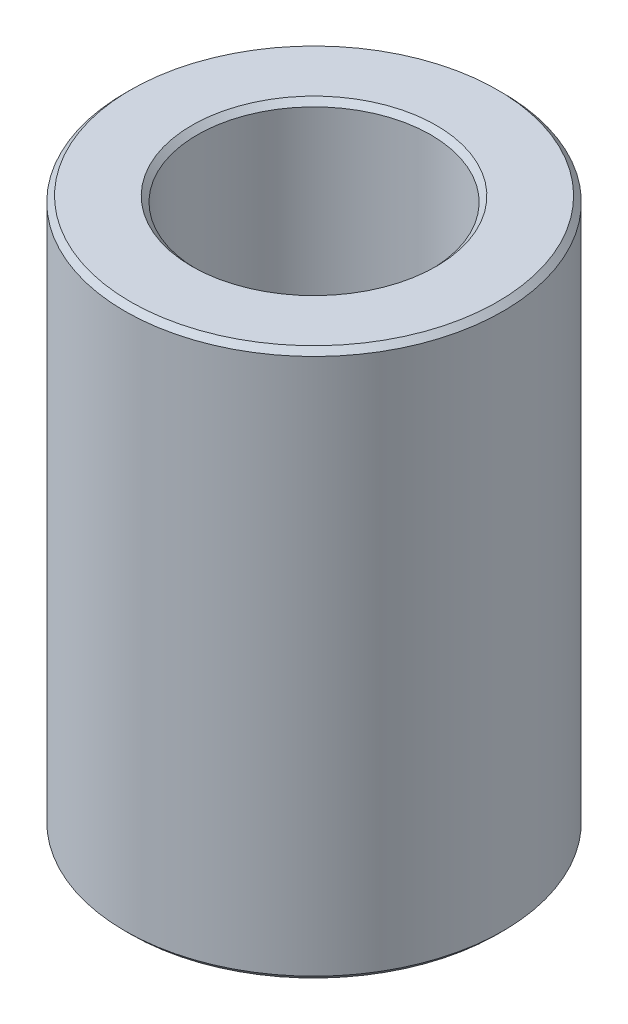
ISO-10303-21;
HEADER;
FILE_DESCRIPTION(('STEP AP214'),'2;1');
FILE_NAME('part.step','',(''),(''),'','','');
FILE_SCHEMA(('AUTOMOTIVE_DESIGN { 1 0 10303 214 1 1 1 1 }'));
ENDSEC;
DATA;
#1=APPLICATION_CONTEXT('core data for automotive mechanical design processes');
#2=APPLICATION_PROTOCOL_DEFINITION('international standard','automotive_design',2000,#1);
#3=PRODUCT_CONTEXT('',#1,'mechanical');
#4=PRODUCT('Part','Part','',(#3));
#5=PRODUCT_RELATED_PRODUCT_CATEGORY('part','',(#4));
#6=PRODUCT_DEFINITION_FORMATION('','',#4);
#7=PRODUCT_DEFINITION_CONTEXT('part definition',#1,'design');
#8=PRODUCT_DEFINITION('design','',#6,#7);
#9=PRODUCT_DEFINITION_SHAPE('','',#8);
#10=(LENGTH_UNIT() NAMED_UNIT(*) SI_UNIT(.MILLI.,.METRE.));
#11=(NAMED_UNIT(*) PLANE_ANGLE_UNIT() SI_UNIT($,.RADIAN.));
#12=(NAMED_UNIT(*) SI_UNIT($,.STERADIAN.) SOLID_ANGLE_UNIT());
#13=UNCERTAINTY_MEASURE_WITH_UNIT(LENGTH_MEASURE(1.E-05),#10,'distance_accuracy_value','');
#14=(GEOMETRIC_REPRESENTATION_CONTEXT(3) GLOBAL_UNCERTAINTY_ASSIGNED_CONTEXT((#13)) GLOBAL_UNIT_ASSIGNED_CONTEXT((#10,
#11,#12)) REPRESENTATION_CONTEXT('',''));
#15=CARTESIAN_POINT('',(0.,0.,0.));
#16=DIRECTION('',(0.,0.,1.));
#17=DIRECTION('',(1.,0.,0.));
#18=AXIS2_PLACEMENT_3D('',#15,#16,#17);
#19=CARTESIAN_POINT('',(0.,12.51,0.));
#20=DIRECTION('',(0.,1.,0.));
#21=DIRECTION('',(0.,0.,1.));
#22=AXIS2_PLACEMENT_3D('',#19,#20,#21);
#23=PLANE('',#22);
#24=CARTESIAN_POINT('',(0.,12.51,0.));
#25=DIRECTION('',(0.,1.,0.));
#26=DIRECTION('',(0.,0.,1.));
#27=AXIS2_PLACEMENT_3D('',#24,#25,#26);
#28=CIRCLE('',#27,5.584);
#29=CARTESIAN_POINT('',(0.,12.51,5.584));
#30=VERTEX_POINT('',#29);
#31=EDGE_CURVE('E11',#30,#30,#28,.F.);
#32=ORIENTED_EDGE('',*,*,#31,.T.);
#33=EDGE_LOOP('',(#32));
#34=FACE_BOUND('',#33,.T.);
#35=CARTESIAN_POINT('',(0.,12.51,0.));
#36=DIRECTION('',(0.,1.,0.));
#37=DIRECTION('',(0.,0.,1.));
#38=AXIS2_PLACEMENT_3D('',#35,#36,#37);
#39=CIRCLE('',#38,8.38599999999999);
#40=CARTESIAN_POINT('',(0.,12.51,8.38599999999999));
#41=VERTEX_POINT('',#40);
#42=EDGE_CURVE('E43',#41,#41,#39,.T.);
#43=ORIENTED_EDGE('',*,*,#42,.T.);
#44=EDGE_LOOP('',(#43));
#45=FACE_BOUND('',#44,.T.);
#46=ADVANCED_FACE('F36',(#34,#45),#23,.T.);
#47=CARTESIAN_POINT('',(0.,-12.51,0.));
#48=DIRECTION('',(0.,1.,0.));
#49=DIRECTION('',(0.,0.,1.));
#50=AXIS2_PLACEMENT_3D('',#47,#48,#49);
#51=PLANE('',#50);
#52=CARTESIAN_POINT('',(0.,-12.51,0.));
#53=DIRECTION('',(0.,1.,0.));
#54=DIRECTION('',(0.,0.,1.));
#55=AXIS2_PLACEMENT_3D('',#52,#53,#54);
#56=CIRCLE('',#55,5.584);
#57=CARTESIAN_POINT('',(0.,-12.51,5.584));
#58=VERTEX_POINT('',#57);
#59=EDGE_CURVE('E62',#58,#58,#56,.T.);
#60=ORIENTED_EDGE('',*,*,#59,.T.);
#61=EDGE_LOOP('',(#60));
#62=FACE_BOUND('',#61,.T.);
#63=CARTESIAN_POINT('',(0.,-12.51,0.));
#64=DIRECTION('',(0.,1.,0.));
#65=DIRECTION('',(0.,0.,1.));
#66=AXIS2_PLACEMENT_3D('',#63,#64,#65);
#67=CIRCLE('',#66,8.386);
#68=CARTESIAN_POINT('',(0.,-12.51,8.386));
#69=VERTEX_POINT('',#68);
#70=EDGE_CURVE('E65',#69,#69,#67,.F.);
#71=ORIENTED_EDGE('',*,*,#70,.T.);
#72=EDGE_LOOP('',(#71));
#73=FACE_BOUND('',#72,.T.);
#74=ADVANCED_FACE('F69',(#62,#73),#51,.F.);
#75=CARTESIAN_POINT('',(0.,12.51,0.));
#76=DIRECTION('',(0.,-1.,0.));
#77=DIRECTION('',(0.,0.,-1.));
#78=AXIS2_PLACEMENT_3D('',#75,#76,#77);
#79=CYLINDRICAL_SURFACE('',#78,8.636);
#80=CARTESIAN_POINT('',(0.,-12.26,0.));
#81=DIRECTION('',(0.,1.,0.));
#82=DIRECTION('',(0.,0.,1.));
#83=AXIS2_PLACEMENT_3D('',#80,#81,#82);
#84=CIRCLE('',#83,8.636);
#85=CARTESIAN_POINT('',(0.,-12.26,8.636));
#86=VERTEX_POINT('',#85);
#87=EDGE_CURVE('E47',#86,#86,#84,.T.);
#88=ORIENTED_EDGE('',*,*,#87,.T.);
#89=EDGE_LOOP('',(#88));
#90=FACE_BOUND('',#89,.T.);
#91=CARTESIAN_POINT('',(0.,12.26,0.));
#92=DIRECTION('',(0.,1.,0.));
#93=DIRECTION('',(0.,0.,1.));
#94=AXIS2_PLACEMENT_3D('',#91,#92,#93);
#95=CIRCLE('',#94,8.636);
#96=CARTESIAN_POINT('',(0.,12.26,8.636));
#97=VERTEX_POINT('',#96);
#98=EDGE_CURVE('E51',#97,#97,#95,.F.);
#99=ORIENTED_EDGE('',*,*,#98,.T.);
#100=EDGE_LOOP('',(#99));
#101=FACE_BOUND('',#100,.T.);
#102=ADVANCED_FACE('F79',(#90,#101),#79,.T.);
#103=CARTESIAN_POINT('',(0.,12.51,0.));
#104=DIRECTION('',(0.,-1.,0.));
#105=DIRECTION('',(0.,0.,-1.));
#106=AXIS2_PLACEMENT_3D('',#103,#104,#105);
#107=CYLINDRICAL_SURFACE('',#106,5.334);
#108=CARTESIAN_POINT('',(0.,-12.26,0.));
#109=DIRECTION('',(0.,1.,0.));
#110=DIRECTION('',(0.,0.,1.));
#111=AXIS2_PLACEMENT_3D('',#108,#109,#110);
#112=CIRCLE('',#111,5.334);
#113=CARTESIAN_POINT('',(0.,-12.26,5.334));
#114=VERTEX_POINT('',#113);
#115=EDGE_CURVE('E56',#114,#114,#112,.F.);
#116=ORIENTED_EDGE('',*,*,#115,.T.);
#117=EDGE_LOOP('',(#116));
#118=FACE_BOUND('',#117,.T.);
#119=CARTESIAN_POINT('',(0.,12.26,0.));
#120=DIRECTION('',(0.,1.,0.));
#121=DIRECTION('',(0.,0.,1.));
#122=AXIS2_PLACEMENT_3D('',#119,#120,#121);
#123=CIRCLE('',#122,5.334);
#124=CARTESIAN_POINT('',(0.,12.26,5.334));
#125=VERTEX_POINT('',#124);
#126=EDGE_CURVE('E59',#125,#125,#123,.T.);
#127=ORIENTED_EDGE('',*,*,#126,.T.);
#128=EDGE_LOOP('',(#127));
#129=FACE_BOUND('',#128,.T.);
#130=ADVANCED_FACE('F82',(#118,#129),#107,.F.);
#131=CARTESIAN_POINT('',(0.,-12.51,0.));
#132=DIRECTION('',(0.,-1.,0.));
#133=DIRECTION('',(0.,0.,-1.));
#134=AXIS2_PLACEMENT_3D('',#131,#132,#133);
#135=CONICAL_SURFACE('',#134,5.584,0.785398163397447);
#136=ORIENTED_EDGE('',*,*,#115,.F.);
#137=EDGE_LOOP('',(#136));
#138=FACE_BOUND('',#137,.T.);
#139=ORIENTED_EDGE('',*,*,#59,.F.);
#140=EDGE_LOOP('',(#139));
#141=FACE_BOUND('',#140,.T.);
#142=ADVANCED_FACE('F75',(#138,#141),#135,.F.);
#143=CARTESIAN_POINT('',(0.,-12.26,0.));
#144=DIRECTION('',(0.,1.,0.));
#145=DIRECTION('',(0.,0.,1.));
#146=AXIS2_PLACEMENT_3D('',#143,#144,#145);
#147=CONICAL_SURFACE('',#146,8.636,0.785398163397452);
#148=ORIENTED_EDGE('',*,*,#70,.F.);
#149=EDGE_LOOP('',(#148));
#150=FACE_BOUND('',#149,.T.);
#151=ORIENTED_EDGE('',*,*,#87,.F.);
#152=EDGE_LOOP('',(#151));
#153=FACE_BOUND('',#152,.T.);
#154=ADVANCED_FACE('F71',(#150,#153),#147,.T.);
#155=CARTESIAN_POINT('',(0.,12.26,0.));
#156=DIRECTION('',(0.,1.,0.));
#157=DIRECTION('',(0.,0.,1.));
#158=AXIS2_PLACEMENT_3D('',#155,#156,#157);
#159=CONICAL_SURFACE('',#158,5.334,0.785398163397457);
#160=ORIENTED_EDGE('',*,*,#31,.F.);
#161=EDGE_LOOP('',(#160));
#162=FACE_BOUND('',#161,.T.);
#163=ORIENTED_EDGE('',*,*,#126,.F.);
#164=EDGE_LOOP('',(#163));
#165=FACE_BOUND('',#164,.T.);
#166=ADVANCED_FACE('F74',(#162,#165),#159,.F.);
#167=CARTESIAN_POINT('',(0.,12.51,0.));
#168=DIRECTION('',(0.,-1.,0.));
#169=DIRECTION('',(0.,0.,-1.));
#170=AXIS2_PLACEMENT_3D('',#167,#168,#169);
#171=CONICAL_SURFACE('',#170,8.38599999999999,0.785398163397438);
#172=ORIENTED_EDGE('',*,*,#98,.F.);
#173=EDGE_LOOP('',(#172));
#174=FACE_BOUND('',#173,.T.);
#175=ORIENTED_EDGE('',*,*,#42,.F.);
#176=EDGE_LOOP('',(#175));
#177=FACE_BOUND('',#176,.T.);
#178=ADVANCED_FACE('F38',(#174,#177),#171,.T.);
#179=CLOSED_SHELL('',(#46,#74,#102,#130,#142,#154,#166,#178));
#180=MANIFOLD_SOLID_BREP('B2',#179);
#181=ADVANCED_BREP_SHAPE_REPRESENTATION('',(#18,#180),#14);
#182=SHAPE_DEFINITION_REPRESENTATION(#9,#181);
ENDSEC;
END-ISO-10303-21;
